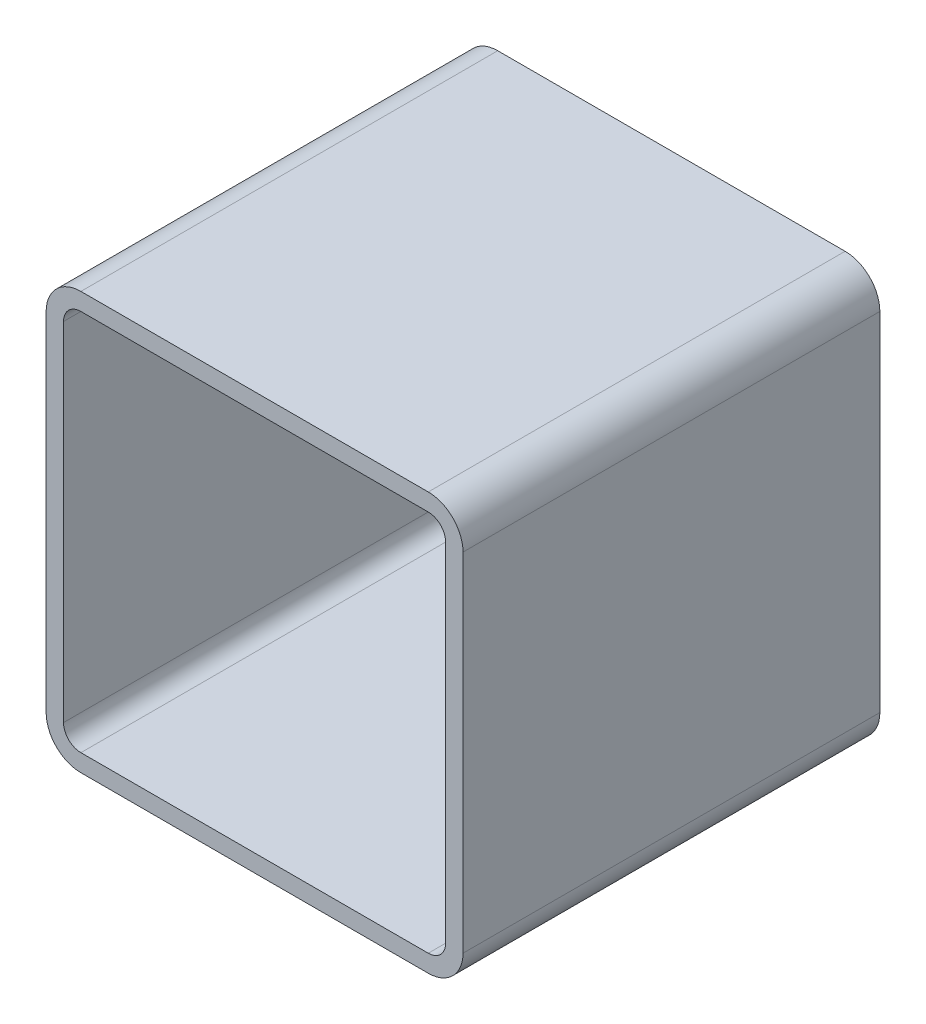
ISO-10303-21;
HEADER;
FILE_DESCRIPTION(('STEP AP214'),'2;1');
FILE_NAME('part.step','',(''),(''),'','','');
FILE_SCHEMA(('AUTOMOTIVE_DESIGN { 1 0 10303 214 1 1 1 1 }'));
ENDSEC;
DATA;
#1=APPLICATION_CONTEXT('core data for automotive mechanical design processes');
#2=APPLICATION_PROTOCOL_DEFINITION('international standard','automotive_design',2000,#1);
#3=PRODUCT_CONTEXT('',#1,'mechanical');
#4=PRODUCT('Part','Part','',(#3));
#5=PRODUCT_RELATED_PRODUCT_CATEGORY('part','',(#4));
#6=PRODUCT_DEFINITION_FORMATION('','',#4);
#7=PRODUCT_DEFINITION_CONTEXT('part definition',#1,'design');
#8=PRODUCT_DEFINITION('design','',#6,#7);
#9=PRODUCT_DEFINITION_SHAPE('','',#8);
#10=(LENGTH_UNIT() NAMED_UNIT(*) SI_UNIT(.MILLI.,.METRE.));
#11=(NAMED_UNIT(*) PLANE_ANGLE_UNIT() SI_UNIT($,.RADIAN.));
#12=(NAMED_UNIT(*) SI_UNIT($,.STERADIAN.) SOLID_ANGLE_UNIT());
#13=UNCERTAINTY_MEASURE_WITH_UNIT(LENGTH_MEASURE(1.E-05),#10,'distance_accuracy_value','');
#14=(GEOMETRIC_REPRESENTATION_CONTEXT(3) GLOBAL_UNCERTAINTY_ASSIGNED_CONTEXT((#13)) GLOBAL_UNIT_ASSIGNED_CONTEXT((#10,
#11,#12)) REPRESENTATION_CONTEXT('',''));
#15=CARTESIAN_POINT('',(0.,0.,0.));
#16=DIRECTION('',(0.,0.,1.));
#17=DIRECTION('',(1.,0.,0.));
#18=AXIS2_PLACEMENT_3D('',#15,#16,#17);
#19=CARTESIAN_POINT('',(26.5067030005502,281.274496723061,304.8));
#20=DIRECTION('',(0.,0.,1.));
#21=DIRECTION('',(1.,0.,0.));
#22=AXIS2_PLACEMENT_3D('',#19,#20,#21);
#23=PLANE('',#22);
#24=CARTESIAN_POINT('',(26.5067030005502,281.274496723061,304.8));
#25=DIRECTION('',(0.,0.,1.));
#26=DIRECTION('',(1.,0.,0.));
#27=AXIS2_PLACEMENT_3D('',#24,#25,#26);
#28=CIRCLE('',#27,25.4);
#29=CARTESIAN_POINT('',(26.5067030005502,306.674496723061,304.8));
#30=VERTEX_POINT('',#29);
#31=CARTESIAN_POINT('',(1.10670300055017,281.274496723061,304.8));
#32=VERTEX_POINT('',#31);
#33=EDGE_CURVE('E211',#30,#32,#28,.T.);
#34=ORIENTED_EDGE('',*,*,#33,.T.);
#35=DIRECTION('',(0.,-1.,0.));
#36=VECTOR('',#35,1.);
#37=CARTESIAN_POINT('',(1.10670300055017,27.2744967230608,304.8));
#38=LINE('',#37,#36);
#39=CARTESIAN_POINT('',(1.10670300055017,27.2744967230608,304.8));
#40=VERTEX_POINT('',#39);
#41=EDGE_CURVE('E214',#32,#40,#38,.T.);
#42=ORIENTED_EDGE('',*,*,#41,.T.);
#43=CARTESIAN_POINT('',(26.5067030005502,27.2744967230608,304.8));
#44=DIRECTION('',(0.,0.,1.));
#45=DIRECTION('',(1.,0.,0.));
#46=AXIS2_PLACEMENT_3D('',#43,#44,#45);
#47=CIRCLE('',#46,25.4);
#48=CARTESIAN_POINT('',(26.5067030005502,1.87449672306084,304.8));
#49=VERTEX_POINT('',#48);
#50=EDGE_CURVE('E217',#40,#49,#47,.T.);
#51=ORIENTED_EDGE('',*,*,#50,.T.);
#52=DIRECTION('',(1.,0.,0.));
#53=VECTOR('',#52,1.);
#54=CARTESIAN_POINT('',(280.50670300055,1.87449672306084,304.8));
#55=LINE('',#54,#53);
#56=CARTESIAN_POINT('',(280.50670300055,1.87449672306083,304.8));
#57=VERTEX_POINT('',#56);
#58=EDGE_CURVE('E219',#49,#57,#55,.T.);
#59=ORIENTED_EDGE('',*,*,#58,.T.);
#60=CARTESIAN_POINT('',(280.50670300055,27.2744967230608,304.8));
#61=DIRECTION('',(0.,0.,1.));
#62=DIRECTION('',(1.,0.,0.));
#63=AXIS2_PLACEMENT_3D('',#60,#61,#62);
#64=CIRCLE('',#63,25.4);
#65=CARTESIAN_POINT('',(305.90670300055,27.2744967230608,304.8));
#66=VERTEX_POINT('',#65);
#67=EDGE_CURVE('E221',#57,#66,#64,.T.);
#68=ORIENTED_EDGE('',*,*,#67,.T.);
#69=DIRECTION('',(0.,1.,0.));
#70=VECTOR('',#69,1.);
#71=CARTESIAN_POINT('',(305.90670300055,281.274496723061,304.8));
#72=LINE('',#71,#70);
#73=CARTESIAN_POINT('',(305.90670300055,281.274496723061,304.8));
#74=VERTEX_POINT('',#73);
#75=EDGE_CURVE('E223',#66,#74,#72,.T.);
#76=ORIENTED_EDGE('',*,*,#75,.T.);
#77=CARTESIAN_POINT('',(280.50670300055,281.274496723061,304.8));
#78=DIRECTION('',(0.,0.,1.));
#79=DIRECTION('',(1.,0.,0.));
#80=AXIS2_PLACEMENT_3D('',#77,#78,#79);
#81=CIRCLE('',#80,25.4);
#82=CARTESIAN_POINT('',(280.50670300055,306.674496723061,304.8));
#83=VERTEX_POINT('',#82);
#84=EDGE_CURVE('E225',#74,#83,#81,.T.);
#85=ORIENTED_EDGE('',*,*,#84,.T.);
#86=DIRECTION('',(-1.,0.,0.));
#87=VECTOR('',#86,1.);
#88=CARTESIAN_POINT('',(26.5067030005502,306.674496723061,304.8));
#89=LINE('',#88,#87);
#90=EDGE_CURVE('E227',#83,#30,#89,.T.);
#91=ORIENTED_EDGE('',*,*,#90,.T.);
#92=EDGE_LOOP('',(#34,#42,#51,#59,#68,#76,#85,#91));
#93=FACE_BOUND('',#92,.T.);
#94=DIRECTION('',(0.,-1.,0.));
#95=VECTOR('',#94,1.);
#96=CARTESIAN_POINT('',(13.8067030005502,27.2744967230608,304.8));
#97=LINE('',#96,#95);
#98=CARTESIAN_POINT('',(13.8067030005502,281.274496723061,304.8));
#99=VERTEX_POINT('',#98);
#100=CARTESIAN_POINT('',(13.8067030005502,27.2744967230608,304.8));
#101=VERTEX_POINT('',#100);
#102=EDGE_CURVE('E154',#99,#101,#97,.T.);
#103=ORIENTED_EDGE('',*,*,#102,.F.);
#104=CARTESIAN_POINT('',(26.5067030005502,281.274496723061,304.8));
#105=DIRECTION('',(0.,0.,1.));
#106=DIRECTION('',(1.,0.,0.));
#107=AXIS2_PLACEMENT_3D('',#104,#105,#106);
#108=CIRCLE('',#107,12.7);
#109=CARTESIAN_POINT('',(26.5067030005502,293.974496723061,304.8));
#110=VERTEX_POINT('',#109);
#111=EDGE_CURVE('E146',#110,#99,#108,.T.);
#112=ORIENTED_EDGE('',*,*,#111,.F.);
#113=DIRECTION('',(-1.,0.,0.));
#114=VECTOR('',#113,1.);
#115=CARTESIAN_POINT('',(26.5067030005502,293.974496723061,304.8));
#116=LINE('',#115,#114);
#117=CARTESIAN_POINT('',(280.50670300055,293.974496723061,304.8));
#118=VERTEX_POINT('',#117);
#119=EDGE_CURVE('E179',#118,#110,#116,.T.);
#120=ORIENTED_EDGE('',*,*,#119,.F.);
#121=CARTESIAN_POINT('',(280.50670300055,281.274496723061,304.8));
#122=DIRECTION('',(0.,0.,1.));
#123=DIRECTION('',(1.,0.,0.));
#124=AXIS2_PLACEMENT_3D('',#121,#122,#123);
#125=CIRCLE('',#124,12.7);
#126=CARTESIAN_POINT('',(293.20670300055,281.274496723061,304.8));
#127=VERTEX_POINT('',#126);
#128=EDGE_CURVE('E177',#127,#118,#125,.T.);
#129=ORIENTED_EDGE('',*,*,#128,.F.);
#130=DIRECTION('',(0.,1.,0.));
#131=VECTOR('',#130,1.);
#132=CARTESIAN_POINT('',(293.20670300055,281.274496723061,304.8));
#133=LINE('',#132,#131);
#134=CARTESIAN_POINT('',(293.20670300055,27.2744967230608,304.8));
#135=VERTEX_POINT('',#134);
#136=EDGE_CURVE('E175',#135,#127,#133,.T.);
#137=ORIENTED_EDGE('',*,*,#136,.F.);
#138=CARTESIAN_POINT('',(280.50670300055,27.2744967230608,304.8));
#139=DIRECTION('',(0.,0.,1.));
#140=DIRECTION('',(1.,0.,0.));
#141=AXIS2_PLACEMENT_3D('',#138,#139,#140);
#142=CIRCLE('',#141,12.7);
#143=CARTESIAN_POINT('',(280.50670300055,14.5744967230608,304.8));
#144=VERTEX_POINT('',#143);
#145=EDGE_CURVE('E173',#144,#135,#142,.T.);
#146=ORIENTED_EDGE('',*,*,#145,.F.);
#147=DIRECTION('',(1.,0.,0.));
#148=VECTOR('',#147,1.);
#149=CARTESIAN_POINT('',(280.50670300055,14.5744967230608,304.8));
#150=LINE('',#149,#148);
#151=CARTESIAN_POINT('',(26.5067030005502,14.5744967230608,304.8));
#152=VERTEX_POINT('',#151);
#153=EDGE_CURVE('E169',#152,#144,#150,.T.);
#154=ORIENTED_EDGE('',*,*,#153,.F.);
#155=CARTESIAN_POINT('',(26.5067030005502,27.2744967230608,304.8));
#156=DIRECTION('',(0.,0.,1.));
#157=DIRECTION('',(1.,0.,0.));
#158=AXIS2_PLACEMENT_3D('',#155,#156,#157);
#159=CIRCLE('',#158,12.7);
#160=EDGE_CURVE('E167',#101,#152,#159,.T.);
#161=ORIENTED_EDGE('',*,*,#160,.F.);
#162=EDGE_LOOP('',(#103,#112,#120,#129,#137,#146,#154,#161));
#163=FACE_BOUND('',#162,.T.);
#164=ADVANCED_FACE('F33',(#93,#163),#23,.T.);
#165=CARTESIAN_POINT('',(26.5067030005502,281.274496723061,0.));
#166=DIRECTION('',(0.,0.,1.));
#167=DIRECTION('',(1.,0.,0.));
#168=AXIS2_PLACEMENT_3D('',#165,#166,#167);
#169=PLANE('',#168);
#170=CARTESIAN_POINT('',(26.5067030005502,281.274496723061,0.));
#171=DIRECTION('',(0.,0.,1.));
#172=DIRECTION('',(1.,0.,0.));
#173=AXIS2_PLACEMENT_3D('',#170,#171,#172);
#174=CIRCLE('',#173,25.4);
#175=CARTESIAN_POINT('',(26.5067030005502,306.674496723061,0.));
#176=VERTEX_POINT('',#175);
#177=CARTESIAN_POINT('',(1.10670300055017,281.274496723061,0.));
#178=VERTEX_POINT('',#177);
#179=EDGE_CURVE('E162',#176,#178,#174,.T.);
#180=ORIENTED_EDGE('',*,*,#179,.F.);
#181=DIRECTION('',(-1.,0.,0.));
#182=VECTOR('',#181,1.);
#183=CARTESIAN_POINT('',(26.5067030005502,306.674496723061,0.));
#184=LINE('',#183,#182);
#185=CARTESIAN_POINT('',(280.50670300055,306.674496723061,0.));
#186=VERTEX_POINT('',#185);
#187=EDGE_CURVE('E215',#186,#176,#184,.T.);
#188=ORIENTED_EDGE('',*,*,#187,.F.);
#189=CARTESIAN_POINT('',(280.50670300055,281.274496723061,0.));
#190=DIRECTION('',(0.,0.,1.));
#191=DIRECTION('',(1.,0.,0.));
#192=AXIS2_PLACEMENT_3D('',#189,#190,#191);
#193=CIRCLE('',#192,25.4);
#194=CARTESIAN_POINT('',(305.90670300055,281.274496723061,0.));
#195=VERTEX_POINT('',#194);
#196=EDGE_CURVE('E242',#195,#186,#193,.T.);
#197=ORIENTED_EDGE('',*,*,#196,.F.);
#198=DIRECTION('',(0.,1.,0.));
#199=VECTOR('',#198,1.);
#200=CARTESIAN_POINT('',(305.90670300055,281.274496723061,0.));
#201=LINE('',#200,#199);
#202=CARTESIAN_POINT('',(305.90670300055,27.2744967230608,0.));
#203=VERTEX_POINT('',#202);
#204=EDGE_CURVE('E240',#203,#195,#201,.T.);
#205=ORIENTED_EDGE('',*,*,#204,.F.);
#206=CARTESIAN_POINT('',(280.50670300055,27.2744967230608,0.));
#207=DIRECTION('',(0.,0.,1.));
#208=DIRECTION('',(1.,0.,0.));
#209=AXIS2_PLACEMENT_3D('',#206,#207,#208);
#210=CIRCLE('',#209,25.4);
#211=CARTESIAN_POINT('',(280.50670300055,1.87449672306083,0.));
#212=VERTEX_POINT('',#211);
#213=EDGE_CURVE('E238',#212,#203,#210,.T.);
#214=ORIENTED_EDGE('',*,*,#213,.F.);
#215=DIRECTION('',(1.,0.,0.));
#216=VECTOR('',#215,1.);
#217=CARTESIAN_POINT('',(280.50670300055,1.87449672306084,0.));
#218=LINE('',#217,#216);
#219=CARTESIAN_POINT('',(26.5067030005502,1.87449672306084,0.));
#220=VERTEX_POINT('',#219);
#221=EDGE_CURVE('E236',#220,#212,#218,.T.);
#222=ORIENTED_EDGE('',*,*,#221,.F.);
#223=CARTESIAN_POINT('',(26.5067030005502,27.2744967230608,0.));
#224=DIRECTION('',(0.,0.,1.));
#225=DIRECTION('',(1.,0.,0.));
#226=AXIS2_PLACEMENT_3D('',#223,#224,#225);
#227=CIRCLE('',#226,25.4);
#228=CARTESIAN_POINT('',(1.10670300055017,27.2744967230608,0.));
#229=VERTEX_POINT('',#228);
#230=EDGE_CURVE('E234',#229,#220,#227,.T.);
#231=ORIENTED_EDGE('',*,*,#230,.F.);
#232=DIRECTION('',(0.,-1.,0.));
#233=VECTOR('',#232,1.);
#234=CARTESIAN_POINT('',(1.10670300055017,27.2744967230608,0.));
#235=LINE('',#234,#233);
#236=EDGE_CURVE('E232',#178,#229,#235,.T.);
#237=ORIENTED_EDGE('',*,*,#236,.F.);
#238=EDGE_LOOP('',(#180,#188,#197,#205,#214,#222,#231,#237));
#239=FACE_BOUND('',#238,.T.);
#240=CARTESIAN_POINT('',(26.5067030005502,281.274496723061,0.));
#241=DIRECTION('',(0.,0.,1.));
#242=DIRECTION('',(1.,0.,0.));
#243=AXIS2_PLACEMENT_3D('',#240,#241,#242);
#244=CIRCLE('',#243,12.7);
#245=CARTESIAN_POINT('',(26.5067030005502,293.974496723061,0.));
#246=VERTEX_POINT('',#245);
#247=CARTESIAN_POINT('',(13.8067030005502,281.274496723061,0.));
#248=VERTEX_POINT('',#247);
#249=EDGE_CURVE('E56',#246,#248,#244,.T.);
#250=ORIENTED_EDGE('',*,*,#249,.T.);
#251=DIRECTION('',(0.,-1.,0.));
#252=VECTOR('',#251,1.);
#253=CARTESIAN_POINT('',(13.8067030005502,27.2744967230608,0.));
#254=LINE('',#253,#252);
#255=CARTESIAN_POINT('',(13.8067030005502,27.2744967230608,0.));
#256=VERTEX_POINT('',#255);
#257=EDGE_CURVE('E161',#248,#256,#254,.T.);
#258=ORIENTED_EDGE('',*,*,#257,.T.);
#259=CARTESIAN_POINT('',(26.5067030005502,27.2744967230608,0.));
#260=DIRECTION('',(0.,0.,1.));
#261=DIRECTION('',(1.,0.,0.));
#262=AXIS2_PLACEMENT_3D('',#259,#260,#261);
#263=CIRCLE('',#262,12.7);
#264=CARTESIAN_POINT('',(26.5067030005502,14.5744967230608,0.));
#265=VERTEX_POINT('',#264);
#266=EDGE_CURVE('E183',#256,#265,#263,.T.);
#267=ORIENTED_EDGE('',*,*,#266,.T.);
#268=DIRECTION('',(1.,0.,0.));
#269=VECTOR('',#268,1.);
#270=CARTESIAN_POINT('',(280.50670300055,14.5744967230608,0.));
#271=LINE('',#270,#269);
#272=CARTESIAN_POINT('',(280.50670300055,14.5744967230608,0.));
#273=VERTEX_POINT('',#272);
#274=EDGE_CURVE('E186',#265,#273,#271,.T.);
#275=ORIENTED_EDGE('',*,*,#274,.T.);
#276=CARTESIAN_POINT('',(280.50670300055,27.2744967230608,0.));
#277=DIRECTION('',(0.,0.,1.));
#278=DIRECTION('',(1.,0.,0.));
#279=AXIS2_PLACEMENT_3D('',#276,#277,#278);
#280=CIRCLE('',#279,12.7);
#281=CARTESIAN_POINT('',(293.20670300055,27.2744967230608,0.));
#282=VERTEX_POINT('',#281);
#283=EDGE_CURVE('E189',#273,#282,#280,.T.);
#284=ORIENTED_EDGE('',*,*,#283,.T.);
#285=DIRECTION('',(0.,1.,0.));
#286=VECTOR('',#285,1.);
#287=CARTESIAN_POINT('',(293.20670300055,281.274496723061,0.));
#288=LINE('',#287,#286);
#289=CARTESIAN_POINT('',(293.20670300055,281.274496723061,0.));
#290=VERTEX_POINT('',#289);
#291=EDGE_CURVE('E192',#282,#290,#288,.T.);
#292=ORIENTED_EDGE('',*,*,#291,.T.);
#293=CARTESIAN_POINT('',(280.50670300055,281.274496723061,0.));
#294=DIRECTION('',(0.,0.,1.));
#295=DIRECTION('',(1.,0.,0.));
#296=AXIS2_PLACEMENT_3D('',#293,#294,#295);
#297=CIRCLE('',#296,12.7);
#298=CARTESIAN_POINT('',(280.50670300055,293.974496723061,0.));
#299=VERTEX_POINT('',#298);
#300=EDGE_CURVE('E195',#290,#299,#297,.T.);
#301=ORIENTED_EDGE('',*,*,#300,.T.);
#302=DIRECTION('',(-1.,0.,0.));
#303=VECTOR('',#302,1.);
#304=CARTESIAN_POINT('',(26.5067030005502,293.974496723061,0.));
#305=LINE('',#304,#303);
#306=EDGE_CURVE('E155',#299,#246,#305,.T.);
#307=ORIENTED_EDGE('',*,*,#306,.T.);
#308=EDGE_LOOP('',(#250,#258,#267,#275,#284,#292,#301,#307));
#309=FACE_BOUND('',#308,.T.);
#310=ADVANCED_FACE('F272',(#239,#309),#169,.F.);
#311=CARTESIAN_POINT('',(26.5067030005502,281.274496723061,304.8));
#312=DIRECTION('',(0.,0.,-1.));
#313=DIRECTION('',(-1.,0.,0.));
#314=AXIS2_PLACEMENT_3D('',#311,#312,#313);
#315=CYLINDRICAL_SURFACE('',#314,25.4);
#316=ORIENTED_EDGE('',*,*,#179,.T.);
#317=DIRECTION('',(0.,0.,-1.));
#318=VECTOR('',#317,1.);
#319=CARTESIAN_POINT('',(1.10670300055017,281.274496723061,304.8));
#320=LINE('',#319,#318);
#321=EDGE_CURVE('E11',#32,#178,#320,.T.);
#322=ORIENTED_EDGE('',*,*,#321,.F.);
#323=ORIENTED_EDGE('',*,*,#33,.F.);
#324=DIRECTION('',(0.,0.,-1.));
#325=VECTOR('',#324,1.);
#326=CARTESIAN_POINT('',(26.5067030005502,306.674496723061,304.8));
#327=LINE('',#326,#325);
#328=EDGE_CURVE('E229',#30,#176,#327,.T.);
#329=ORIENTED_EDGE('',*,*,#328,.T.);
#330=EDGE_LOOP('',(#316,#322,#323,#329));
#331=FACE_BOUND('',#330,.T.);
#332=ADVANCED_FACE('F35',(#331),#315,.T.);
#333=CARTESIAN_POINT('',(1.10670300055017,27.2744967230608,304.8));
#334=DIRECTION('',(1.,0.,0.));
#335=DIRECTION('',(0.,0.,-1.));
#336=AXIS2_PLACEMENT_3D('',#333,#334,#335);
#337=PLANE('',#336);
#338=ORIENTED_EDGE('',*,*,#236,.T.);
#339=DIRECTION('',(0.,0.,-1.));
#340=VECTOR('',#339,1.);
#341=CARTESIAN_POINT('',(1.10670300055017,27.2744967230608,304.8));
#342=LINE('',#341,#340);
#343=EDGE_CURVE('E41',#40,#229,#342,.T.);
#344=ORIENTED_EDGE('',*,*,#343,.F.);
#345=ORIENTED_EDGE('',*,*,#41,.F.);
#346=ORIENTED_EDGE('',*,*,#321,.T.);
#347=EDGE_LOOP('',(#338,#344,#345,#346));
#348=FACE_BOUND('',#347,.T.);
#349=ADVANCED_FACE('F289',(#348),#337,.F.);
#350=CARTESIAN_POINT('',(26.5067030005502,27.2744967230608,304.8));
#351=DIRECTION('',(0.,0.,-1.));
#352=DIRECTION('',(-1.,0.,0.));
#353=AXIS2_PLACEMENT_3D('',#350,#351,#352);
#354=CYLINDRICAL_SURFACE('',#353,25.4);
#355=ORIENTED_EDGE('',*,*,#230,.T.);
#356=DIRECTION('',(0.,0.,-1.));
#357=VECTOR('',#356,1.);
#358=CARTESIAN_POINT('',(26.5067030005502,1.87449672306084,304.8));
#359=LINE('',#358,#357);
#360=EDGE_CURVE('E259',#49,#220,#359,.T.);
#361=ORIENTED_EDGE('',*,*,#360,.F.);
#362=ORIENTED_EDGE('',*,*,#50,.F.);
#363=ORIENTED_EDGE('',*,*,#343,.T.);
#364=EDGE_LOOP('',(#355,#361,#362,#363));
#365=FACE_BOUND('',#364,.T.);
#366=ADVANCED_FACE('F266',(#365),#354,.T.);
#367=CARTESIAN_POINT('',(280.50670300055,1.87449672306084,304.8));
#368=DIRECTION('',(0.,1.,0.));
#369=DIRECTION('',(0.,0.,1.));
#370=AXIS2_PLACEMENT_3D('',#367,#368,#369);
#371=PLANE('',#370);
#372=ORIENTED_EDGE('',*,*,#221,.T.);
#373=DIRECTION('',(0.,0.,-1.));
#374=VECTOR('',#373,1.);
#375=CARTESIAN_POINT('',(280.50670300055,1.87449672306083,304.8));
#376=LINE('',#375,#374);
#377=EDGE_CURVE('E256',#57,#212,#376,.T.);
#378=ORIENTED_EDGE('',*,*,#377,.F.);
#379=ORIENTED_EDGE('',*,*,#58,.F.);
#380=ORIENTED_EDGE('',*,*,#360,.T.);
#381=EDGE_LOOP('',(#372,#378,#379,#380));
#382=FACE_BOUND('',#381,.T.);
#383=ADVANCED_FACE('F278',(#382),#371,.F.);
#384=CARTESIAN_POINT('',(280.50670300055,27.2744967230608,304.8));
#385=DIRECTION('',(0.,0.,-1.));
#386=DIRECTION('',(-1.,0.,0.));
#387=AXIS2_PLACEMENT_3D('',#384,#385,#386);
#388=CYLINDRICAL_SURFACE('',#387,25.4);
#389=ORIENTED_EDGE('',*,*,#213,.T.);
#390=DIRECTION('',(0.,0.,-1.));
#391=VECTOR('',#390,1.);
#392=CARTESIAN_POINT('',(305.90670300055,27.2744967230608,304.8));
#393=LINE('',#392,#391);
#394=EDGE_CURVE('E253',#66,#203,#393,.T.);
#395=ORIENTED_EDGE('',*,*,#394,.F.);
#396=ORIENTED_EDGE('',*,*,#67,.F.);
#397=ORIENTED_EDGE('',*,*,#377,.T.);
#398=EDGE_LOOP('',(#389,#395,#396,#397));
#399=FACE_BOUND('',#398,.T.);
#400=ADVANCED_FACE('F282',(#399),#388,.T.);
#401=CARTESIAN_POINT('',(305.90670300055,281.274496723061,304.8));
#402=DIRECTION('',(-1.,0.,0.));
#403=DIRECTION('',(0.,0.,1.));
#404=AXIS2_PLACEMENT_3D('',#401,#402,#403);
#405=PLANE('',#404);
#406=ORIENTED_EDGE('',*,*,#204,.T.);
#407=DIRECTION('',(0.,0.,-1.));
#408=VECTOR('',#407,1.);
#409=CARTESIAN_POINT('',(305.90670300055,281.274496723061,304.8));
#410=LINE('',#409,#408);
#411=EDGE_CURVE('E250',#74,#195,#410,.T.);
#412=ORIENTED_EDGE('',*,*,#411,.F.);
#413=ORIENTED_EDGE('',*,*,#75,.F.);
#414=ORIENTED_EDGE('',*,*,#394,.T.);
#415=EDGE_LOOP('',(#406,#412,#413,#414));
#416=FACE_BOUND('',#415,.T.);
#417=ADVANCED_FACE('F302',(#416),#405,.F.);
#418=CARTESIAN_POINT('',(280.50670300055,281.274496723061,304.8));
#419=DIRECTION('',(0.,0.,-1.));
#420=DIRECTION('',(-1.,0.,0.));
#421=AXIS2_PLACEMENT_3D('',#418,#419,#420);
#422=CYLINDRICAL_SURFACE('',#421,25.4);
#423=ORIENTED_EDGE('',*,*,#196,.T.);
#424=DIRECTION('',(0.,0.,-1.));
#425=VECTOR('',#424,1.);
#426=CARTESIAN_POINT('',(280.50670300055,306.674496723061,304.8));
#427=LINE('',#426,#425);
#428=EDGE_CURVE('E247',#83,#186,#427,.T.);
#429=ORIENTED_EDGE('',*,*,#428,.F.);
#430=ORIENTED_EDGE('',*,*,#84,.F.);
#431=ORIENTED_EDGE('',*,*,#411,.T.);
#432=EDGE_LOOP('',(#423,#429,#430,#431));
#433=FACE_BOUND('',#432,.T.);
#434=ADVANCED_FACE('F300',(#433),#422,.T.);
#435=CARTESIAN_POINT('',(26.5067030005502,306.674496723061,304.8));
#436=DIRECTION('',(0.,-1.,0.));
#437=DIRECTION('',(0.,0.,-1.));
#438=AXIS2_PLACEMENT_3D('',#435,#436,#437);
#439=PLANE('',#438);
#440=ORIENTED_EDGE('',*,*,#187,.T.);
#441=ORIENTED_EDGE('',*,*,#328,.F.);
#442=ORIENTED_EDGE('',*,*,#90,.F.);
#443=ORIENTED_EDGE('',*,*,#428,.T.);
#444=EDGE_LOOP('',(#440,#441,#442,#443));
#445=FACE_BOUND('',#444,.T.);
#446=ADVANCED_FACE('F295',(#445),#439,.F.);
#447=CARTESIAN_POINT('',(26.5067030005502,281.274496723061,304.8));
#448=DIRECTION('',(0.,0.,-1.));
#449=DIRECTION('',(-1.,0.,0.));
#450=AXIS2_PLACEMENT_3D('',#447,#448,#449);
#451=CYLINDRICAL_SURFACE('',#450,12.7);
#452=ORIENTED_EDGE('',*,*,#249,.F.);
#453=DIRECTION('',(0.,0.,-1.));
#454=VECTOR('',#453,1.);
#455=CARTESIAN_POINT('',(26.5067030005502,293.974496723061,304.8));
#456=LINE('',#455,#454);
#457=EDGE_CURVE('E150',#110,#246,#456,.T.);
#458=ORIENTED_EDGE('',*,*,#457,.F.);
#459=ORIENTED_EDGE('',*,*,#111,.T.);
#460=DIRECTION('',(0.,0.,-1.));
#461=VECTOR('',#460,1.);
#462=CARTESIAN_POINT('',(13.8067030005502,281.274496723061,304.8));
#463=LINE('',#462,#461);
#464=EDGE_CURVE('E149',#99,#248,#463,.T.);
#465=ORIENTED_EDGE('',*,*,#464,.T.);
#466=EDGE_LOOP('',(#452,#458,#459,#465));
#467=FACE_BOUND('',#466,.T.);
#468=ADVANCED_FACE('F148',(#467),#451,.F.);
#469=CARTESIAN_POINT('',(13.8067030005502,27.2744967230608,304.8));
#470=DIRECTION('',(1.,0.,0.));
#471=DIRECTION('',(0.,0.,-1.));
#472=AXIS2_PLACEMENT_3D('',#469,#470,#471);
#473=PLANE('',#472);
#474=ORIENTED_EDGE('',*,*,#257,.F.);
#475=ORIENTED_EDGE('',*,*,#464,.F.);
#476=ORIENTED_EDGE('',*,*,#102,.T.);
#477=DIRECTION('',(0.,0.,-1.));
#478=VECTOR('',#477,1.);
#479=CARTESIAN_POINT('',(13.8067030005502,27.2744967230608,304.8));
#480=LINE('',#479,#478);
#481=EDGE_CURVE('E163',#101,#256,#480,.T.);
#482=ORIENTED_EDGE('',*,*,#481,.T.);
#483=EDGE_LOOP('',(#474,#475,#476,#482));
#484=FACE_BOUND('',#483,.T.);
#485=ADVANCED_FACE('F158',(#484),#473,.T.);
#486=CARTESIAN_POINT('',(26.5067030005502,27.2744967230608,304.8));
#487=DIRECTION('',(0.,0.,-1.));
#488=DIRECTION('',(-1.,0.,0.));
#489=AXIS2_PLACEMENT_3D('',#486,#487,#488);
#490=CYLINDRICAL_SURFACE('',#489,12.7);
#491=ORIENTED_EDGE('',*,*,#266,.F.);
#492=ORIENTED_EDGE('',*,*,#481,.F.);
#493=ORIENTED_EDGE('',*,*,#160,.T.);
#494=DIRECTION('',(0.,0.,-1.));
#495=VECTOR('',#494,1.);
#496=CARTESIAN_POINT('',(26.5067030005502,14.5744967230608,304.8));
#497=LINE('',#496,#495);
#498=EDGE_CURVE('E208',#152,#265,#497,.T.);
#499=ORIENTED_EDGE('',*,*,#498,.T.);
#500=EDGE_LOOP('',(#491,#492,#493,#499));
#501=FACE_BOUND('',#500,.T.);
#502=ADVANCED_FACE('F327',(#501),#490,.F.);
#503=CARTESIAN_POINT('',(280.50670300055,14.5744967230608,304.8));
#504=DIRECTION('',(0.,1.,0.));
#505=DIRECTION('',(0.,0.,1.));
#506=AXIS2_PLACEMENT_3D('',#503,#504,#505);
#507=PLANE('',#506);
#508=ORIENTED_EDGE('',*,*,#274,.F.);
#509=ORIENTED_EDGE('',*,*,#498,.F.);
#510=ORIENTED_EDGE('',*,*,#153,.T.);
#511=DIRECTION('',(0.,0.,-1.));
#512=VECTOR('',#511,1.);
#513=CARTESIAN_POINT('',(280.50670300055,14.5744967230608,304.8));
#514=LINE('',#513,#512);
#515=EDGE_CURVE('E206',#144,#273,#514,.T.);
#516=ORIENTED_EDGE('',*,*,#515,.T.);
#517=EDGE_LOOP('',(#508,#509,#510,#516));
#518=FACE_BOUND('',#517,.T.);
#519=ADVANCED_FACE('F331',(#518),#507,.T.);
#520=CARTESIAN_POINT('',(280.50670300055,27.2744967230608,304.8));
#521=DIRECTION('',(0.,0.,-1.));
#522=DIRECTION('',(-1.,0.,0.));
#523=AXIS2_PLACEMENT_3D('',#520,#521,#522);
#524=CYLINDRICAL_SURFACE('',#523,12.7);
#525=ORIENTED_EDGE('',*,*,#283,.F.);
#526=ORIENTED_EDGE('',*,*,#515,.F.);
#527=ORIENTED_EDGE('',*,*,#145,.T.);
#528=DIRECTION('',(0.,0.,-1.));
#529=VECTOR('',#528,1.);
#530=CARTESIAN_POINT('',(293.20670300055,27.2744967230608,304.8));
#531=LINE('',#530,#529);
#532=EDGE_CURVE('E204',#135,#282,#531,.T.);
#533=ORIENTED_EDGE('',*,*,#532,.T.);
#534=EDGE_LOOP('',(#525,#526,#527,#533));
#535=FACE_BOUND('',#534,.T.);
#536=ADVANCED_FACE('F337',(#535),#524,.F.);
#537=CARTESIAN_POINT('',(293.20670300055,281.274496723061,304.8));
#538=DIRECTION('',(-1.,0.,0.));
#539=DIRECTION('',(0.,0.,1.));
#540=AXIS2_PLACEMENT_3D('',#537,#538,#539);
#541=PLANE('',#540);
#542=ORIENTED_EDGE('',*,*,#291,.F.);
#543=ORIENTED_EDGE('',*,*,#532,.F.);
#544=ORIENTED_EDGE('',*,*,#136,.T.);
#545=DIRECTION('',(0.,0.,-1.));
#546=VECTOR('',#545,1.);
#547=CARTESIAN_POINT('',(293.20670300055,281.274496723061,304.8));
#548=LINE('',#547,#546);
#549=EDGE_CURVE('E202',#127,#290,#548,.T.);
#550=ORIENTED_EDGE('',*,*,#549,.T.);
#551=EDGE_LOOP('',(#542,#543,#544,#550));
#552=FACE_BOUND('',#551,.T.);
#553=ADVANCED_FACE('F341',(#552),#541,.T.);
#554=CARTESIAN_POINT('',(280.50670300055,281.274496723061,304.8));
#555=DIRECTION('',(0.,0.,-1.));
#556=DIRECTION('',(-1.,0.,0.));
#557=AXIS2_PLACEMENT_3D('',#554,#555,#556);
#558=CYLINDRICAL_SURFACE('',#557,12.7);
#559=ORIENTED_EDGE('',*,*,#300,.F.);
#560=ORIENTED_EDGE('',*,*,#549,.F.);
#561=ORIENTED_EDGE('',*,*,#128,.T.);
#562=DIRECTION('',(0.,0.,-1.));
#563=VECTOR('',#562,1.);
#564=CARTESIAN_POINT('',(280.50670300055,293.974496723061,304.8));
#565=LINE('',#564,#563);
#566=EDGE_CURVE('E48',#118,#299,#565,.T.);
#567=ORIENTED_EDGE('',*,*,#566,.T.);
#568=EDGE_LOOP('',(#559,#560,#561,#567));
#569=FACE_BOUND('',#568,.T.);
#570=ADVANCED_FACE('F345',(#569),#558,.F.);
#571=CARTESIAN_POINT('',(26.5067030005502,293.974496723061,304.8));
#572=DIRECTION('',(0.,-1.,0.));
#573=DIRECTION('',(0.,0.,-1.));
#574=AXIS2_PLACEMENT_3D('',#571,#572,#573);
#575=PLANE('',#574);
#576=ORIENTED_EDGE('',*,*,#306,.F.);
#577=ORIENTED_EDGE('',*,*,#566,.F.);
#578=ORIENTED_EDGE('',*,*,#119,.T.);
#579=ORIENTED_EDGE('',*,*,#457,.T.);
#580=EDGE_LOOP('',(#576,#577,#578,#579));
#581=FACE_BOUND('',#580,.T.);
#582=ADVANCED_FACE('F349',(#581),#575,.T.);
#583=CLOSED_SHELL('',(#164,#310,#332,#349,#366,#383,#400,#417,#434,#446,#468,#485,#502,#519,
#536,#553,#570,#582));
#584=MANIFOLD_SOLID_BREP('B2',#583);
#585=ADVANCED_BREP_SHAPE_REPRESENTATION('',(#18,#584),#14);
#586=SHAPE_DEFINITION_REPRESENTATION(#9,#585);
ENDSEC;
END-ISO-10303-21;
